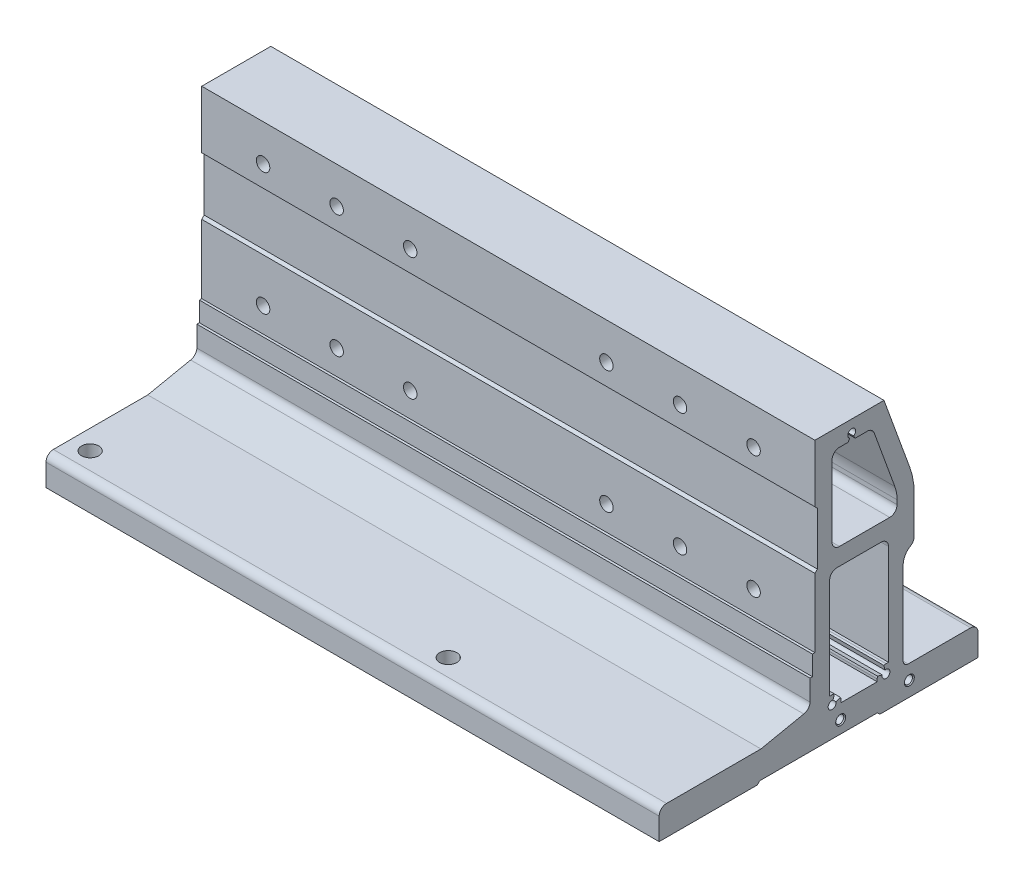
from build123d import *

# Parameters (mm, degrees)
EXTRUDE_1_DEPTH              = 125
HOLE_WIZARD_M5_1_D           = 5.5
HOLE_WIZARD_M5_1_CBORE_D     = 9.5
HOLE_WIZARD_M5_1_CBORE_DEPTH = 34.5
HOLE_WIZARD_M4_1_D           = 3.3
HOLE_WIZARD_M4_1_DEPTH       = 10
HOLE_WIZARD_M4_1_CSINK_D     = 4.05
HOLE_WIZARD_M4_1_CSINK_ANGLE = 90
HOLE_WIZARD_M4_1_TIP         = 0.991420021
F_5_0MM_1_D                  = 5
F_5_0MM_1_DEPTH              = 10
F_5_0MM_1_TIP                = 1.502151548
HOLE_WIZARD_7_0_7_1_D        = 7
PATTERN_LINEAR_1_COUNT       = 2
PATTERN_LINEAR_1_PITCH       = 140


with BuildPart() as part:
    # Sketch 1 → Extrude 1 (new, symmetric)
    with BuildSketch(Plane(origin=(0, 0, 0), x_dir=(0, 0, -1), z_dir=(1, 0, 0))):
        with BuildLine():
            Line((26.665451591, 109), (-1.5, 109))
            Line((-1.5, 109), (-1.5, 85.5))
            Line((-1.5, 85.5), (-0.5, 84.5))
            Line((-0.5, 84.5), (-0.5, 63))
            Line((-0.5, 63), (-1.5, 62))
            Line((-1.5, 62), (-1.5, 34))
            Line((-1.5, 34), (-2.5, 34))
            Line((-2.5, 34), (-2.5, 26))
            Line((-2.5, 26), (-3.5, 26))
            Line((-3.5, 26), (-3.5, 17.566096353))
            ThreePointArc((-3.5, 17.566096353), (-4.220229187, 15.616059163), (-6.035096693, 14.602337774))
            Line((-6.035096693, 14.602337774), (-23.5, 11))
            Line((-23.5, 11), (-62, 11))
            ThreePointArc((-62, 11), (-64.121320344, 10.121320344), (-65, 8))
            Line((-65, 8), (-65, -1))
            Line((-65, -1), (-25, -1))
            Line((-25, -1), (-24, 0))
            Line((-24, 0), (24, 0))
            Line((24, 0), (25, -1))
            Line((25, -1), (65, -1))
            Line((65, -1), (65, 8))
            ThreePointArc((65, 8), (64.121320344, 10.121320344), (62, 11))
            Line((62, 11), (36.5, 11))
            ThreePointArc((36.5, 11), (35.085786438, 11.585786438), (34.5, 13))
            Line((34.5, 13), (34.5, 47))
            ThreePointArc((34.5, 47), (35.303847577, 50), (37.5, 52.196152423))
            ThreePointArc((37.5, 52.196152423), (38.598076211, 53.294228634), (39, 54.794228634))
            Line((39, 54.794228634), (39, 69.821297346))
            ThreePointArc((39, 69.821297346), (38.54423259, 75.030742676), (37.190778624, 80.081901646))
            Line((37.190778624, 80.081901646), (26.665451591, 109))
        make_face()
        with BuildLine():
            Line((25.5, 59.5), (7.5, 59.5))
            ThreePointArc((7.5, 59.5), (5.378679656, 58.621320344), (4.5, 56.5))
            Line((4.5, 56.5), (4.5, 15.6))
            Line((4.5, 15.6), (5.5, 15.6))
            ThreePointArc((5.5, 15.6), (5.969894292, 15.569201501), (6.431748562, 15.477332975))
            Line((6.431748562, 15.477332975), (5.914110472, 13.545481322))
            ThreePointArc((5.914110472, 13.545481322), (4.36862915, 10.86862915), (7.045481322, 12.414110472))
            Line((7.045481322, 12.414110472), (8.977332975, 12.931748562))
            ThreePointArc((8.977332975, 12.931748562), (9.069201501, 12.469894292), (9.1, 12))
            Line((9.1, 12), (9.1, 11))
            Line((9.1, 11), (23.9, 11))
            Line((23.9, 11), (23.9, 12))
            ThreePointArc((23.9, 12), (23.930798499, 12.469894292), (24.022667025, 12.931748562))
            Line((24.022667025, 12.931748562), (25.954518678, 12.414110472))
            ThreePointArc((25.954518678, 12.414110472), (28.63137085, 10.86862915), (27.085889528, 13.545481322))
            Line((27.085889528, 13.545481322), (26.568251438, 15.477332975))
            ThreePointArc((26.568251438, 15.477332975), (27.030105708, 15.569201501), (27.5, 15.6))
            Line((27.5, 15.6), (28.5, 15.6))
            Line((28.5, 15.6), (28.5, 56.5))
            ThreePointArc((28.5, 56.5), (27.621320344, 58.621320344), (25.5, 59.5))
        make_face(mode=Mode.SUBTRACT)
        with BuildLine():
            Line((12.7, 102.614356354), (12.056626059, 101.5))
            Line((12.056626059, 101.5), (8.5, 101.5))
            ThreePointArc((8.5, 101.5), (6.378679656, 100.621320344), (5.5, 98.5))
            Line((5.5, 98.5), (5.5, 69.5))
            ThreePointArc((5.5, 69.5), (6.378679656, 67.378679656), (8.5, 66.5))
            Line((8.5, 66.5), (29, 66.5))
            ThreePointArc((29, 66.5), (31.121320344, 67.378679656), (32, 69.5))
            Line((32, 69.5), (32, 71.231913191))
            ThreePointArc((32, 71.231913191), (31.772116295, 73.836635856), (31.095389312, 76.362215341))
            Line((31.095389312, 76.362215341), (22.664439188, 99.52606043))
            ThreePointArc((22.664439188, 99.52606043), (21.566090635, 100.957456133), (19.845361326, 101.5))
            Line((19.845361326, 101.5), (14.943373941, 101.5))
            Line((14.943373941, 101.5), (14.3, 102.614356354))
            ThreePointArc((14.3, 102.614356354), (13.5, 105.599997), (12.7, 102.614356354))
        make_face(mode=Mode.SUBTRACT)
    extrude(amount=EXTRUDE_1_DEPTH, both=True)

    # Hole Wizard M5 _ _ _ _ _1 (through all)
    with Locations(Plane(origin=(0, 0, -39), x_dir=(-1, 0, 0), z_dir=(0, 0, -1))):
        with Locations((-100, 94), (-70, 94), (-40, 94), (-100, 44), (-70, 44), (-40, 44)):
            hole_wizard_m5_1 = CounterBoreHole(HOLE_WIZARD_M5_1_D / 2, HOLE_WIZARD_M5_1_CBORE_D / 2, HOLE_WIZARD_M5_1_CBORE_DEPTH)

    # Hole Wizard M4 _ _1
    with Locations(Plane(origin=(125, 0, 0), x_dir=(0, 0, -1), z_dir=(1, 0, 0))):
        with Locations((9, 5), (37, 5)):
            CounterSinkHole(HOLE_WIZARD_M4_1_D / 2, HOLE_WIZARD_M4_1_CSINK_D / 2, depth=HOLE_WIZARD_M4_1_DEPTH, counter_sink_angle=HOLE_WIZARD_M4_1_CSINK_ANGLE)
            with Locations((0, 0, -(HOLE_WIZARD_M4_1_DEPTH + HOLE_WIZARD_M4_1_TIP / 2))):  # 118° drill point
                Cone(0, HOLE_WIZARD_M4_1_D / 2, HOLE_WIZARD_M4_1_TIP, mode=Mode.SUBTRACT)

    # 5.0mm _ _1
    with Locations(Plane(origin=(0, 0, 0), x_dir=(-1, 0, 0), z_dir=(0, -1, 0))):
        with Locations((-29, 0), (117, 0)):
            Hole(F_5_0MM_1_D / 2, depth=F_5_0MM_1_DEPTH)
            with Locations((0, 0, -(F_5_0MM_1_DEPTH + F_5_0MM_1_TIP / 2))):  # 118° drill point
                Cone(0, F_5_0MM_1_D / 2, F_5_0MM_1_TIP, mode=Mode.SUBTRACT)

    # Hole Wizard 7.0 _7_ _ _1 (through all)
    with Locations(Plane(origin=(0, -1, 0), x_dir=(-1, 0, 0), z_dir=(0, -1, 0))):
        with Locations((117, -55), (-29, -55), (117, 55), (-29, 55)):
            Hole(HOLE_WIZARD_7_0_7_1_D / 2)

    # Pattern Linear 1: Hole Wizard M5 _ _ _ _ _1 ×2
    with Locations(*[(-i * PATTERN_LINEAR_1_PITCH, 0, 0) for i in range(1, PATTERN_LINEAR_1_COUNT)]):
        add(hole_wizard_m5_1, mode=Mode.SUBTRACT)


solid = part.part
